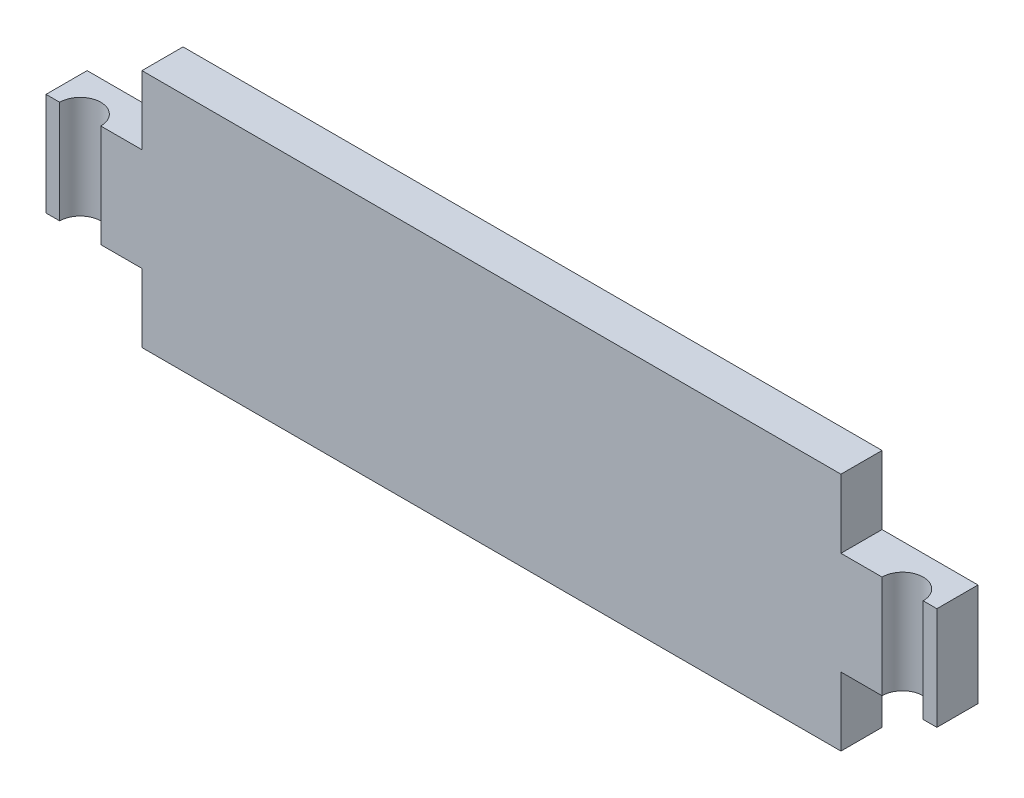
ISO-10303-21;
HEADER;
FILE_DESCRIPTION(('STEP AP214'),'2;1');
FILE_NAME('part.step','',(''),(''),'','','');
FILE_SCHEMA(('AUTOMOTIVE_DESIGN { 1 0 10303 214 1 1 1 1 }'));
ENDSEC;
DATA;
#1=APPLICATION_CONTEXT('core data for automotive mechanical design processes');
#2=APPLICATION_PROTOCOL_DEFINITION('international standard','automotive_design',2000,#1);
#3=PRODUCT_CONTEXT('',#1,'mechanical');
#4=PRODUCT('Part','Part','',(#3));
#5=PRODUCT_RELATED_PRODUCT_CATEGORY('part','',(#4));
#6=PRODUCT_DEFINITION_FORMATION('','',#4);
#7=PRODUCT_DEFINITION_CONTEXT('part definition',#1,'design');
#8=PRODUCT_DEFINITION('design','',#6,#7);
#9=PRODUCT_DEFINITION_SHAPE('','',#8);
#10=(LENGTH_UNIT() NAMED_UNIT(*) SI_UNIT(.MILLI.,.METRE.));
#11=(NAMED_UNIT(*) PLANE_ANGLE_UNIT() SI_UNIT($,.RADIAN.));
#12=(NAMED_UNIT(*) SI_UNIT($,.STERADIAN.) SOLID_ANGLE_UNIT());
#13=UNCERTAINTY_MEASURE_WITH_UNIT(LENGTH_MEASURE(1.E-05),#10,'distance_accuracy_value','');
#14=(GEOMETRIC_REPRESENTATION_CONTEXT(3) GLOBAL_UNCERTAINTY_ASSIGNED_CONTEXT((#13)) GLOBAL_UNIT_ASSIGNED_CONTEXT((#10,
#11,#12)) REPRESENTATION_CONTEXT('',''));
#15=CARTESIAN_POINT('',(0.,0.,0.));
#16=DIRECTION('',(0.,0.,1.));
#17=DIRECTION('',(1.,0.,0.));
#18=AXIS2_PLACEMENT_3D('',#15,#16,#17);
#19=CARTESIAN_POINT('',(-5.,25.,6.));
#20=DIRECTION('',(0.,0.,1.));
#21=DIRECTION('',(1.,0.,0.));
#22=AXIS2_PLACEMENT_3D('',#19,#20,#21);
#23=PLANE('',#22);
#24=DIRECTION('',(0.,1.,0.));
#25=VECTOR('',#24,1.);
#26=CARTESIAN_POINT('',(123.,0.,6.));
#27=LINE('',#26,#25);
#28=CARTESIAN_POINT('',(123.,10.,6.));
#29=VERTEX_POINT('',#28);
#30=CARTESIAN_POINT('',(123.,25.,6.));
#31=VERTEX_POINT('',#30);
#32=EDGE_CURVE('E46',#29,#31,#27,.T.);
#33=ORIENTED_EDGE('',*,*,#32,.F.);
#34=DIRECTION('',(1.,0.,0.));
#35=VECTOR('',#34,1.);
#36=CARTESIAN_POINT('',(111.,10.,6.));
#37=LINE('',#36,#35);
#38=CARTESIAN_POINT('',(125.,10.,6.));
#39=VERTEX_POINT('',#38);
#40=EDGE_CURVE('E239',#29,#39,#37,.T.);
#41=ORIENTED_EDGE('',*,*,#40,.T.);
#42=DIRECTION('',(0.,1.,0.));
#43=VECTOR('',#42,1.);
#44=CARTESIAN_POINT('',(125.,10.,6.));
#45=LINE('',#44,#43);
#46=CARTESIAN_POINT('',(125.,25.,6.));
#47=VERTEX_POINT('',#46);
#48=EDGE_CURVE('E161',#39,#47,#45,.T.);
#49=ORIENTED_EDGE('',*,*,#48,.T.);
#50=DIRECTION('',(-1.,0.,0.));
#51=VECTOR('',#50,1.);
#52=CARTESIAN_POINT('',(125.,25.,6.));
#53=LINE('',#52,#51);
#54=EDGE_CURVE('E160',#47,#31,#53,.T.);
#55=ORIENTED_EDGE('',*,*,#54,.T.);
#56=EDGE_LOOP('',(#33,#41,#49,#55));
#57=FACE_BOUND('',#56,.T.);
#58=ADVANCED_FACE('F31',(#57),#23,.T.);
#59=DIRECTION('',(0.,1.,0.));
#60=VECTOR('',#59,1.);
#61=CARTESIAN_POINT('',(117.,0.,6.));
#62=LINE('',#61,#60);
#63=CARTESIAN_POINT('',(117.,25.,6.));
#64=VERTEX_POINT('',#63);
#65=CARTESIAN_POINT('',(117.,10.,6.));
#66=VERTEX_POINT('',#65);
#67=EDGE_CURVE('E142',#64,#66,#62,.F.);
#68=ORIENTED_EDGE('',*,*,#67,.F.);
#69=CARTESIAN_POINT('',(111.,25.,6.));
#70=VERTEX_POINT('',#69);
#71=EDGE_CURVE('E151',#64,#70,#53,.T.);
#72=ORIENTED_EDGE('',*,*,#71,.T.);
#73=DIRECTION('',(0.,1.,0.));
#74=VECTOR('',#73,1.);
#75=CARTESIAN_POINT('',(111.,25.,6.));
#76=LINE('',#75,#74);
#77=CARTESIAN_POINT('',(111.,35.,6.));
#78=VERTEX_POINT('',#77);
#79=EDGE_CURVE('E163',#70,#78,#76,.T.);
#80=ORIENTED_EDGE('',*,*,#79,.T.);
#81=DIRECTION('',(-1.,0.,0.));
#82=VECTOR('',#81,1.);
#83=CARTESIAN_POINT('',(111.,35.,6.));
#84=LINE('',#83,#82);
#85=CARTESIAN_POINT('',(9.,35.,6.));
#86=VERTEX_POINT('',#85);
#87=EDGE_CURVE('E168',#78,#86,#84,.T.);
#88=ORIENTED_EDGE('',*,*,#87,.T.);
#89=DIRECTION('',(0.,-1.,0.));
#90=VECTOR('',#89,1.);
#91=CARTESIAN_POINT('',(9.,35.,6.));
#92=LINE('',#91,#90);
#93=CARTESIAN_POINT('',(8.99999999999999,25.,6.));
#94=VERTEX_POINT('',#93);
#95=EDGE_CURVE('E170',#86,#94,#92,.T.);
#96=ORIENTED_EDGE('',*,*,#95,.T.);
#97=DIRECTION('',(-1.,0.,0.));
#98=VECTOR('',#97,1.);
#99=CARTESIAN_POINT('',(8.99999999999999,25.,6.));
#100=LINE('',#99,#98);
#101=CARTESIAN_POINT('',(2.99999999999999,25.,6.));
#102=VERTEX_POINT('',#101);
#103=EDGE_CURVE('E216',#94,#102,#100,.T.);
#104=ORIENTED_EDGE('',*,*,#103,.T.);
#105=DIRECTION('',(0.,1.,0.));
#106=VECTOR('',#105,1.);
#107=CARTESIAN_POINT('',(3.,0.,6.));
#108=LINE('',#107,#106);
#109=CARTESIAN_POINT('',(3.,10.,6.));
#110=VERTEX_POINT('',#109);
#111=EDGE_CURVE('E39',#110,#102,#108,.T.);
#112=ORIENTED_EDGE('',*,*,#111,.F.);
#113=DIRECTION('',(1.,0.,0.));
#114=VECTOR('',#113,1.);
#115=CARTESIAN_POINT('',(-5.,10.,6.));
#116=LINE('',#115,#114);
#117=CARTESIAN_POINT('',(9.,10.,6.));
#118=VERTEX_POINT('',#117);
#119=EDGE_CURVE('E225',#110,#118,#116,.T.);
#120=ORIENTED_EDGE('',*,*,#119,.T.);
#121=DIRECTION('',(0.,-1.,0.));
#122=VECTOR('',#121,1.);
#123=CARTESIAN_POINT('',(9.,10.,6.));
#124=LINE('',#123,#122);
#125=CARTESIAN_POINT('',(9.,0.,6.));
#126=VERTEX_POINT('',#125);
#127=EDGE_CURVE('E234',#118,#126,#124,.T.);
#128=ORIENTED_EDGE('',*,*,#127,.T.);
#129=DIRECTION('',(1.,0.,0.));
#130=VECTOR('',#129,1.);
#131=CARTESIAN_POINT('',(9.,0.,6.));
#132=LINE('',#131,#130);
#133=CARTESIAN_POINT('',(111.,0.,6.));
#134=VERTEX_POINT('',#133);
#135=EDGE_CURVE('E236',#126,#134,#132,.T.);
#136=ORIENTED_EDGE('',*,*,#135,.T.);
#137=DIRECTION('',(0.,1.,0.));
#138=VECTOR('',#137,1.);
#139=CARTESIAN_POINT('',(111.,0.,6.));
#140=LINE('',#139,#138);
#141=CARTESIAN_POINT('',(111.,10.,6.));
#142=VERTEX_POINT('',#141);
#143=EDGE_CURVE('E238',#134,#142,#140,.T.);
#144=ORIENTED_EDGE('',*,*,#143,.T.);
#145=EDGE_CURVE('E154',#142,#66,#37,.T.);
#146=ORIENTED_EDGE('',*,*,#145,.T.);
#147=EDGE_LOOP('',(#68,#72,#80,#88,#96,#104,#112,#120,#128,#136,#144,#146));
#148=FACE_BOUND('',#147,.T.);
#149=ADVANCED_FACE('F150',(#148),#23,.T.);
#150=CARTESIAN_POINT('',(8.99999999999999,25.,6.));
#151=DIRECTION('',(0.,-1.,0.));
#152=DIRECTION('',(1.,0.,0.));
#153=AXIS2_PLACEMENT_3D('',#150,#151,#152);
#154=PLANE('',#153);
#155=CARTESIAN_POINT('',(-3.,25.,6.));
#156=VERTEX_POINT('',#155);
#157=CARTESIAN_POINT('',(-5.,25.,6.));
#158=VERTEX_POINT('',#157);
#159=EDGE_CURVE('E218',#156,#158,#100,.T.);
#160=ORIENTED_EDGE('',*,*,#159,.F.);
#161=CARTESIAN_POINT('',(0.,25.,6.));
#162=DIRECTION('',(0.,-1.,0.));
#163=DIRECTION('',(1.,0.,0.));
#164=AXIS2_PLACEMENT_3D('',#161,#162,#163);
#165=CIRCLE('',#164,3.);
#166=EDGE_CURVE('E53',#156,#102,#165,.T.);
#167=ORIENTED_EDGE('',*,*,#166,.T.);
#168=ORIENTED_EDGE('',*,*,#103,.F.);
#169=DIRECTION('',(0.,0.,-1.));
#170=VECTOR('',#169,1.);
#171=CARTESIAN_POINT('',(8.99999999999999,25.,6.));
#172=LINE('',#171,#170);
#173=CARTESIAN_POINT('',(8.99999999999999,25.,0.));
#174=VERTEX_POINT('',#173);
#175=EDGE_CURVE('E172',#94,#174,#172,.T.);
#176=ORIENTED_EDGE('',*,*,#175,.T.);
#177=DIRECTION('',(-1.,0.,0.));
#178=VECTOR('',#177,1.);
#179=CARTESIAN_POINT('',(8.99999999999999,25.,0.));
#180=LINE('',#179,#178);
#181=CARTESIAN_POINT('',(-5.,25.,0.));
#182=VERTEX_POINT('',#181);
#183=EDGE_CURVE('E219',#174,#182,#180,.T.);
#184=ORIENTED_EDGE('',*,*,#183,.T.);
#185=DIRECTION('',(0.,0.,-1.));
#186=VECTOR('',#185,1.);
#187=CARTESIAN_POINT('',(-5.,25.,6.));
#188=LINE('',#187,#186);
#189=EDGE_CURVE('E203',#158,#182,#188,.T.);
#190=ORIENTED_EDGE('',*,*,#189,.F.);
#191=EDGE_LOOP('',(#160,#167,#168,#176,#184,#190));
#192=FACE_BOUND('',#191,.T.);
#193=ADVANCED_FACE('F33',(#192),#154,.F.);
#194=CARTESIAN_POINT('',(-5.,25.,6.));
#195=DIRECTION('',(1.,0.,0.));
#196=DIRECTION('',(0.,1.,0.));
#197=AXIS2_PLACEMENT_3D('',#194,#195,#196);
#198=PLANE('',#197);
#199=DIRECTION('',(0.,-1.,0.));
#200=VECTOR('',#199,1.);
#201=CARTESIAN_POINT('',(-5.,25.,0.));
#202=LINE('',#201,#200);
#203=CARTESIAN_POINT('',(-5.,10.,0.));
#204=VERTEX_POINT('',#203);
#205=EDGE_CURVE('E273',#182,#204,#202,.T.);
#206=ORIENTED_EDGE('',*,*,#205,.T.);
#207=DIRECTION('',(0.,0.,-1.));
#208=VECTOR('',#207,1.);
#209=CARTESIAN_POINT('',(-5.,10.,6.));
#210=LINE('',#209,#208);
#211=CARTESIAN_POINT('',(-5.,10.,6.));
#212=VERTEX_POINT('',#211);
#213=EDGE_CURVE('E200',#212,#204,#210,.T.);
#214=ORIENTED_EDGE('',*,*,#213,.F.);
#215=DIRECTION('',(0.,-1.,0.));
#216=VECTOR('',#215,1.);
#217=CARTESIAN_POINT('',(-5.,25.,6.));
#218=LINE('',#217,#216);
#219=EDGE_CURVE('E223',#158,#212,#218,.T.);
#220=ORIENTED_EDGE('',*,*,#219,.F.);
#221=ORIENTED_EDGE('',*,*,#189,.T.);
#222=EDGE_LOOP('',(#206,#214,#220,#221));
#223=FACE_BOUND('',#222,.T.);
#224=ADVANCED_FACE('F304',(#223),#198,.F.);
#225=CARTESIAN_POINT('',(-5.,10.,6.));
#226=DIRECTION('',(0.,1.,0.));
#227=DIRECTION('',(0.,0.,1.));
#228=AXIS2_PLACEMENT_3D('',#225,#226,#227);
#229=PLANE('',#228);
#230=ORIENTED_EDGE('',*,*,#119,.F.);
#231=CARTESIAN_POINT('',(0.,10.,6.));
#232=DIRECTION('',(0.,1.,0.));
#233=DIRECTION('',(0.,0.,1.));
#234=AXIS2_PLACEMENT_3D('',#231,#232,#233);
#235=CIRCLE('',#234,3.);
#236=CARTESIAN_POINT('',(-3.,10.,6.));
#237=VERTEX_POINT('',#236);
#238=EDGE_CURVE('E210',#110,#237,#235,.T.);
#239=ORIENTED_EDGE('',*,*,#238,.T.);
#240=EDGE_CURVE('E231',#212,#237,#116,.T.);
#241=ORIENTED_EDGE('',*,*,#240,.F.);
#242=ORIENTED_EDGE('',*,*,#213,.T.);
#243=DIRECTION('',(1.,0.,0.));
#244=VECTOR('',#243,1.);
#245=CARTESIAN_POINT('',(-5.,10.,0.));
#246=LINE('',#245,#244);
#247=CARTESIAN_POINT('',(9.,10.,0.));
#248=VERTEX_POINT('',#247);
#249=EDGE_CURVE('E275',#204,#248,#246,.T.);
#250=ORIENTED_EDGE('',*,*,#249,.T.);
#251=DIRECTION('',(0.,0.,-1.));
#252=VECTOR('',#251,1.);
#253=CARTESIAN_POINT('',(9.,10.,6.));
#254=LINE('',#253,#252);
#255=EDGE_CURVE('E197',#118,#248,#254,.T.);
#256=ORIENTED_EDGE('',*,*,#255,.F.);
#257=EDGE_LOOP('',(#230,#239,#241,#242,#250,#256));
#258=FACE_BOUND('',#257,.T.);
#259=ADVANCED_FACE('F297',(#258),#229,.F.);
#260=CARTESIAN_POINT('',(9.,10.,6.));
#261=DIRECTION('',(1.,0.,0.));
#262=DIRECTION('',(0.,0.,-1.));
#263=AXIS2_PLACEMENT_3D('',#260,#261,#262);
#264=PLANE('',#263);
#265=DIRECTION('',(0.,-1.,0.));
#266=VECTOR('',#265,1.);
#267=CARTESIAN_POINT('',(9.,10.,0.));
#268=LINE('',#267,#266);
#269=CARTESIAN_POINT('',(9.,0.,0.));
#270=VERTEX_POINT('',#269);
#271=EDGE_CURVE('E280',#248,#270,#268,.T.);
#272=ORIENTED_EDGE('',*,*,#271,.T.);
#273=DIRECTION('',(0.,0.,-1.));
#274=VECTOR('',#273,1.);
#275=CARTESIAN_POINT('',(9.,0.,6.));
#276=LINE('',#275,#274);
#277=EDGE_CURVE('E194',#126,#270,#276,.T.);
#278=ORIENTED_EDGE('',*,*,#277,.F.);
#279=ORIENTED_EDGE('',*,*,#127,.F.);
#280=ORIENTED_EDGE('',*,*,#255,.T.);
#281=EDGE_LOOP('',(#272,#278,#279,#280));
#282=FACE_BOUND('',#281,.T.);
#283=ADVANCED_FACE('F308',(#282),#264,.F.);
#284=CARTESIAN_POINT('',(9.,0.,6.));
#285=DIRECTION('',(0.,1.,0.));
#286=DIRECTION('',(0.,0.,1.));
#287=AXIS2_PLACEMENT_3D('',#284,#285,#286);
#288=PLANE('',#287);
#289=DIRECTION('',(1.,0.,0.));
#290=VECTOR('',#289,1.);
#291=CARTESIAN_POINT('',(9.,0.,0.));
#292=LINE('',#291,#290);
#293=CARTESIAN_POINT('',(111.,0.,0.));
#294=VERTEX_POINT('',#293);
#295=EDGE_CURVE('E282',#270,#294,#292,.T.);
#296=ORIENTED_EDGE('',*,*,#295,.T.);
#297=DIRECTION('',(0.,0.,-1.));
#298=VECTOR('',#297,1.);
#299=CARTESIAN_POINT('',(111.,0.,6.));
#300=LINE('',#299,#298);
#301=EDGE_CURVE('E191',#134,#294,#300,.T.);
#302=ORIENTED_EDGE('',*,*,#301,.F.);
#303=ORIENTED_EDGE('',*,*,#135,.F.);
#304=ORIENTED_EDGE('',*,*,#277,.T.);
#305=EDGE_LOOP('',(#296,#302,#303,#304));
#306=FACE_BOUND('',#305,.T.);
#307=ADVANCED_FACE('F312',(#306),#288,.F.);
#308=CARTESIAN_POINT('',(111.,0.,6.));
#309=DIRECTION('',(-1.,0.,0.));
#310=DIRECTION('',(0.,0.,1.));
#311=AXIS2_PLACEMENT_3D('',#308,#309,#310);
#312=PLANE('',#311);
#313=DIRECTION('',(0.,1.,0.));
#314=VECTOR('',#313,1.);
#315=CARTESIAN_POINT('',(111.,0.,0.));
#316=LINE('',#315,#314);
#317=CARTESIAN_POINT('',(111.,10.,0.));
#318=VERTEX_POINT('',#317);
#319=EDGE_CURVE('E284',#294,#318,#316,.T.);
#320=ORIENTED_EDGE('',*,*,#319,.T.);
#321=DIRECTION('',(0.,0.,-1.));
#322=VECTOR('',#321,1.);
#323=CARTESIAN_POINT('',(111.,10.,6.));
#324=LINE('',#323,#322);
#325=EDGE_CURVE('E188',#142,#318,#324,.T.);
#326=ORIENTED_EDGE('',*,*,#325,.F.);
#327=ORIENTED_EDGE('',*,*,#143,.F.);
#328=ORIENTED_EDGE('',*,*,#301,.T.);
#329=EDGE_LOOP('',(#320,#326,#327,#328));
#330=FACE_BOUND('',#329,.T.);
#331=ADVANCED_FACE('F288',(#330),#312,.F.);
#332=CARTESIAN_POINT('',(111.,10.,6.));
#333=DIRECTION('',(0.,1.,0.));
#334=DIRECTION('',(0.,0.,1.));
#335=AXIS2_PLACEMENT_3D('',#332,#333,#334);
#336=PLANE('',#335);
#337=ORIENTED_EDGE('',*,*,#40,.F.);
#338=CARTESIAN_POINT('',(120.,10.,5.99999999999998));
#339=DIRECTION('',(0.,1.,0.));
#340=DIRECTION('',(0.,0.,1.));
#341=AXIS2_PLACEMENT_3D('',#338,#339,#340);
#342=CIRCLE('',#341,3.00000000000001);
#343=EDGE_CURVE('E292',#29,#66,#342,.T.);
#344=ORIENTED_EDGE('',*,*,#343,.T.);
#345=ORIENTED_EDGE('',*,*,#145,.F.);
#346=ORIENTED_EDGE('',*,*,#325,.T.);
#347=DIRECTION('',(1.,0.,0.));
#348=VECTOR('',#347,1.);
#349=CARTESIAN_POINT('',(111.,10.,0.));
#350=LINE('',#349,#348);
#351=CARTESIAN_POINT('',(125.,10.,0.));
#352=VERTEX_POINT('',#351);
#353=EDGE_CURVE('E248',#318,#352,#350,.T.);
#354=ORIENTED_EDGE('',*,*,#353,.T.);
#355=DIRECTION('',(0.,0.,-1.));
#356=VECTOR('',#355,1.);
#357=CARTESIAN_POINT('',(125.,10.,6.));
#358=LINE('',#357,#356);
#359=EDGE_CURVE('E185',#39,#352,#358,.T.);
#360=ORIENTED_EDGE('',*,*,#359,.F.);
#361=EDGE_LOOP('',(#337,#344,#345,#346,#354,#360));
#362=FACE_BOUND('',#361,.T.);
#363=ADVANCED_FACE('F246',(#362),#336,.F.);
#364=CARTESIAN_POINT('',(125.,10.,6.));
#365=DIRECTION('',(-1.,0.,0.));
#366=DIRECTION('',(0.,0.,1.));
#367=AXIS2_PLACEMENT_3D('',#364,#365,#366);
#368=PLANE('',#367);
#369=DIRECTION('',(0.,1.,0.));
#370=VECTOR('',#369,1.);
#371=CARTESIAN_POINT('',(125.,10.,0.));
#372=LINE('',#371,#370);
#373=CARTESIAN_POINT('',(125.,25.,0.));
#374=VERTEX_POINT('',#373);
#375=EDGE_CURVE('E252',#352,#374,#372,.T.);
#376=ORIENTED_EDGE('',*,*,#375,.T.);
#377=DIRECTION('',(0.,0.,-1.));
#378=VECTOR('',#377,1.);
#379=CARTESIAN_POINT('',(125.,25.,6.));
#380=LINE('',#379,#378);
#381=EDGE_CURVE('E182',#47,#374,#380,.T.);
#382=ORIENTED_EDGE('',*,*,#381,.F.);
#383=ORIENTED_EDGE('',*,*,#48,.F.);
#384=ORIENTED_EDGE('',*,*,#359,.T.);
#385=EDGE_LOOP('',(#376,#382,#383,#384));
#386=FACE_BOUND('',#385,.T.);
#387=ADVANCED_FACE('F251',(#386),#368,.F.);
#388=CARTESIAN_POINT('',(125.,25.,6.));
#389=DIRECTION('',(0.,-1.,0.));
#390=DIRECTION('',(1.,0.,0.));
#391=AXIS2_PLACEMENT_3D('',#388,#389,#390);
#392=PLANE('',#391);
#393=ORIENTED_EDGE('',*,*,#71,.F.);
#394=CARTESIAN_POINT('',(120.,25.,5.99999999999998));
#395=DIRECTION('',(0.,-1.,0.));
#396=DIRECTION('',(1.,0.,0.));
#397=AXIS2_PLACEMENT_3D('',#394,#395,#396);
#398=CIRCLE('',#397,3.00000000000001);
#399=EDGE_CURVE('E11',#64,#31,#398,.T.);
#400=ORIENTED_EDGE('',*,*,#399,.T.);
#401=ORIENTED_EDGE('',*,*,#54,.F.);
#402=ORIENTED_EDGE('',*,*,#381,.T.);
#403=DIRECTION('',(-1.,0.,0.));
#404=VECTOR('',#403,1.);
#405=CARTESIAN_POINT('',(125.,25.,0.));
#406=LINE('',#405,#404);
#407=CARTESIAN_POINT('',(111.,25.,0.));
#408=VERTEX_POINT('',#407);
#409=EDGE_CURVE('E254',#374,#408,#406,.T.);
#410=ORIENTED_EDGE('',*,*,#409,.T.);
#411=DIRECTION('',(0.,0.,-1.));
#412=VECTOR('',#411,1.);
#413=CARTESIAN_POINT('',(111.,25.,6.));
#414=LINE('',#413,#412);
#415=EDGE_CURVE('E158',#70,#408,#414,.T.);
#416=ORIENTED_EDGE('',*,*,#415,.F.);
#417=EDGE_LOOP('',(#393,#400,#401,#402,#410,#416));
#418=FACE_BOUND('',#417,.T.);
#419=ADVANCED_FACE('F156',(#418),#392,.F.);
#420=CARTESIAN_POINT('',(111.,25.,6.));
#421=DIRECTION('',(-1.,0.,0.));
#422=DIRECTION('',(0.,0.,1.));
#423=AXIS2_PLACEMENT_3D('',#420,#421,#422);
#424=PLANE('',#423);
#425=DIRECTION('',(0.,1.,0.));
#426=VECTOR('',#425,1.);
#427=CARTESIAN_POINT('',(111.,25.,0.));
#428=LINE('',#427,#426);
#429=CARTESIAN_POINT('',(111.,35.,0.));
#430=VERTEX_POINT('',#429);
#431=EDGE_CURVE('E260',#408,#430,#428,.T.);
#432=ORIENTED_EDGE('',*,*,#431,.T.);
#433=DIRECTION('',(0.,0.,-1.));
#434=VECTOR('',#433,1.);
#435=CARTESIAN_POINT('',(111.,35.,6.));
#436=LINE('',#435,#434);
#437=EDGE_CURVE('E178',#78,#430,#436,.T.);
#438=ORIENTED_EDGE('',*,*,#437,.F.);
#439=ORIENTED_EDGE('',*,*,#79,.F.);
#440=ORIENTED_EDGE('',*,*,#415,.T.);
#441=EDGE_LOOP('',(#432,#438,#439,#440));
#442=FACE_BOUND('',#441,.T.);
#443=ADVANCED_FACE('F339',(#442),#424,.F.);
#444=CARTESIAN_POINT('',(111.,35.,6.));
#445=DIRECTION('',(0.,-1.,0.));
#446=DIRECTION('',(1.,0.,0.));
#447=AXIS2_PLACEMENT_3D('',#444,#445,#446);
#448=PLANE('',#447);
#449=DIRECTION('',(-1.,0.,0.));
#450=VECTOR('',#449,1.);
#451=CARTESIAN_POINT('',(111.,35.,0.));
#452=LINE('',#451,#450);
#453=CARTESIAN_POINT('',(9.,35.,0.));
#454=VERTEX_POINT('',#453);
#455=EDGE_CURVE('E262',#430,#454,#452,.T.);
#456=ORIENTED_EDGE('',*,*,#455,.T.);
#457=DIRECTION('',(0.,0.,-1.));
#458=VECTOR('',#457,1.);
#459=CARTESIAN_POINT('',(9.,35.,6.));
#460=LINE('',#459,#458);
#461=EDGE_CURVE('E175',#86,#454,#460,.T.);
#462=ORIENTED_EDGE('',*,*,#461,.F.);
#463=ORIENTED_EDGE('',*,*,#87,.F.);
#464=ORIENTED_EDGE('',*,*,#437,.T.);
#465=EDGE_LOOP('',(#456,#462,#463,#464));
#466=FACE_BOUND('',#465,.T.);
#467=ADVANCED_FACE('F335',(#466),#448,.F.);
#468=CARTESIAN_POINT('',(9.,35.,6.));
#469=DIRECTION('',(1.,0.,0.));
#470=DIRECTION('',(0.,1.,0.));
#471=AXIS2_PLACEMENT_3D('',#468,#469,#470);
#472=PLANE('',#471);
#473=DIRECTION('',(0.,-1.,0.));
#474=VECTOR('',#473,1.);
#475=CARTESIAN_POINT('',(9.,35.,0.));
#476=LINE('',#475,#474);
#477=EDGE_CURVE('E227',#454,#174,#476,.T.);
#478=ORIENTED_EDGE('',*,*,#477,.T.);
#479=ORIENTED_EDGE('',*,*,#175,.F.);
#480=ORIENTED_EDGE('',*,*,#95,.F.);
#481=ORIENTED_EDGE('',*,*,#461,.T.);
#482=EDGE_LOOP('',(#478,#479,#480,#481));
#483=FACE_BOUND('',#482,.T.);
#484=ADVANCED_FACE('F270',(#483),#472,.F.);
#485=DIRECTION('',(0.,1.,0.));
#486=VECTOR('',#485,1.);
#487=CARTESIAN_POINT('',(-3.,0.,6.));
#488=LINE('',#487,#486);
#489=EDGE_CURVE('E206',#156,#237,#488,.F.);
#490=ORIENTED_EDGE('',*,*,#489,.F.);
#491=ORIENTED_EDGE('',*,*,#159,.T.);
#492=ORIENTED_EDGE('',*,*,#219,.T.);
#493=ORIENTED_EDGE('',*,*,#240,.T.);
#494=EDGE_LOOP('',(#490,#491,#492,#493));
#495=FACE_BOUND('',#494,.T.);
#496=ADVANCED_FACE('F300',(#495),#23,.T.);
#497=CARTESIAN_POINT('',(-5.,25.,0.));
#498=DIRECTION('',(0.,0.,1.));
#499=DIRECTION('',(1.,0.,0.));
#500=AXIS2_PLACEMENT_3D('',#497,#498,#499);
#501=PLANE('',#500);
#502=ORIENTED_EDGE('',*,*,#183,.F.);
#503=ORIENTED_EDGE('',*,*,#477,.F.);
#504=ORIENTED_EDGE('',*,*,#455,.F.);
#505=ORIENTED_EDGE('',*,*,#431,.F.);
#506=ORIENTED_EDGE('',*,*,#409,.F.);
#507=ORIENTED_EDGE('',*,*,#375,.F.);
#508=ORIENTED_EDGE('',*,*,#353,.F.);
#509=ORIENTED_EDGE('',*,*,#319,.F.);
#510=ORIENTED_EDGE('',*,*,#295,.F.);
#511=ORIENTED_EDGE('',*,*,#271,.F.);
#512=ORIENTED_EDGE('',*,*,#249,.F.);
#513=ORIENTED_EDGE('',*,*,#205,.F.);
#514=EDGE_LOOP('',(#502,#503,#504,#505,#506,#507,#508,#509,#510,#511,#512,#513));
#515=FACE_BOUND('',#514,.T.);
#516=ADVANCED_FACE('F258',(#515),#501,.F.);
#517=CARTESIAN_POINT('',(0.,0.,6.));
#518=DIRECTION('',(0.,1.,0.));
#519=DIRECTION('',(-1.,0.,0.));
#520=AXIS2_PLACEMENT_3D('',#517,#518,#519);
#521=CYLINDRICAL_SURFACE('',#520,3.);
#522=ORIENTED_EDGE('',*,*,#111,.T.);
#523=ORIENTED_EDGE('',*,*,#166,.F.);
#524=ORIENTED_EDGE('',*,*,#489,.T.);
#525=ORIENTED_EDGE('',*,*,#238,.F.);
#526=EDGE_LOOP('',(#522,#523,#524,#525));
#527=FACE_BOUND('',#526,.T.);
#528=ADVANCED_FACE('F208',(#527),#521,.F.);
#529=CARTESIAN_POINT('',(120.,0.,5.99999999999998));
#530=DIRECTION('',(0.,1.,0.));
#531=DIRECTION('',(-1.,0.,0.));
#532=AXIS2_PLACEMENT_3D('',#529,#530,#531);
#533=CYLINDRICAL_SURFACE('',#532,3.00000000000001);
#534=ORIENTED_EDGE('',*,*,#32,.T.);
#535=ORIENTED_EDGE('',*,*,#399,.F.);
#536=ORIENTED_EDGE('',*,*,#67,.T.);
#537=ORIENTED_EDGE('',*,*,#343,.F.);
#538=EDGE_LOOP('',(#534,#535,#536,#537));
#539=FACE_BOUND('',#538,.T.);
#540=ADVANCED_FACE('F141',(#539),#533,.F.);
#541=CLOSED_SHELL('',(#58,#149,#193,#224,#259,#283,#307,#331,#363,#387,#419,#443,#467,#484,#496,
#516,#528,#540));
#542=MANIFOLD_SOLID_BREP('B2',#541);
#543=ADVANCED_BREP_SHAPE_REPRESENTATION('',(#18,#542),#14);
#544=SHAPE_DEFINITION_REPRESENTATION(#9,#543);
ENDSEC;
END-ISO-10303-21;
